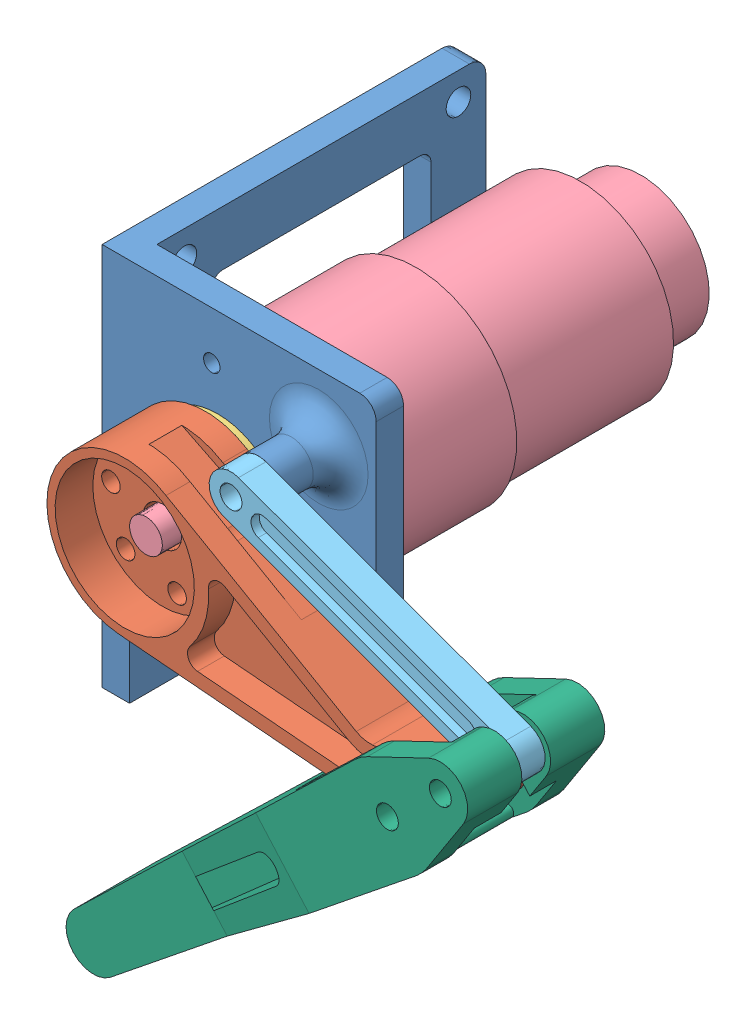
SolidWorks assembly Leg Assembly.SLDASM, configuration Default (file format 4700). Lengths in mm.
Overall size (97.2 105.25 94.13).
6 component instances, 6 part files, 13 mates.
Components (placement in the parent):
- Base-1: Base.SLDPRT [Default] at origin size (50 70 76)
- Thigh-1: Thigh.SLDPRT [Default] at (-1.709 -11.6035 11) x (0.999377 -0.035291 0) z (0 0 1) size (73.28 31.08 14.75)
- Hub-1: Hub.SLDPRT [Default] at (0 0 14) x (-0.929157 -0.369686 0) z (0 0 -1) size (25.4 25.4 9.14)
- Motor-1: Motor.SLDPRT [Default] at (5.2515 4.6283 -52) x (-0.750216 -0.661193 0) z (0 0 1) size (36.8 36.8 85)
- Link-1: Link.SLDPRT [Default] at (14.5161 12.8487 16) x (0.939509 -0.342524 0) z (0 0 1) size (59.42 8 5)
- Shin-1: Shin.SLDPRT [Default] at (53.1666 -13.2798 6.125) x (-0.750084 -0.661343 0) z (0 0 1) size (101.03 17 25)
Mates (geometry in assembly coordinates):
- Concentric1: concentric aligned: cylinder of Base-1 through (0 0 0) axis (0 0 -1) radius 6.5; cylinder of Motor-1 through (0 0 22) axis (0 0 -1) radius 3
- Concentric2: concentric anti-aligned: cylinder of Base-1 through (-4.997 16.2567 0) axis (0 0 -1) radius 1.5; cylinder of Motor-1 through (-4.997 16.2567 0) axis (0 0 1) radius 1.5
- Coincident1: coincident anti-aligned: plane of Base-1 through (-20 25 0) normal (0 0 -1); plane of Motor-1 through (-8.5525 -7.5376 0) normal (0 0 1)
- Concentric4: concentric anti-aligned: cylinder of Hub-1 through (0 0 5.106) axis (0 0 1) radius 2.9845; cylinder of Motor-1 through (0 0 22) axis (0 0 -1) radius 3
- Concentric6: concentric aligned: cylinder of Base-1 through (14.5161 12.8487 16) axis (0 0 -1) radius 1.6618; cylinder of Link-1 through (14.5161 12.8487 16) axis (0 0 -1) radius 2
- Coincident2: coincident anti-aligned: plane of Base-1 through (14.5161 12.8487 16) normal (0 0 1); plane of Link-1 through (14.5161 12.8487 16) normal (0 0 -1)
- Concentric7: concentric anti-aligned: cylinder of Thigh-1 through (0 0 11.25) axis (0 0 -1) radius 12.8; cylinder of Hub-1 through (0 0 9.17) axis (0 0 1) radius 12.7
- Coincident3: coincident anti-aligned: plane of Thigh-1 through (3.4978 -0.1235 14.25) normal (0 0 -1); plane of Hub-1 through (0 0 14.25) normal (0 0 1)
- Concentric8: concentric aligned: cylinder of Link-1 through (62.8253 -4.7638 16) axis (0 0 -1) radius 2; cylinder of Shin-1 through (62.8253 -4.7638 21.25) axis (0 0 -1) radius 2
- Coincident4: coincident anti-aligned: plane of Link-1 through (14.5161 12.8487 16) normal (0 0 -1); plane of Shin-1 through (62.8253 -4.7638 16) normal (0 0 1)
- Concentric9: concentric aligned: cylinder of Thigh-1 through (53.1666 -13.2798 11.25) axis (0 0 -1) radius 2; cylinder of Shin-1 through (53.1666 -13.2798 26.125) axis (0 0 -1) radius 2
- Coincident5: coincident anti-aligned: plane of Thigh-1 through (62.5477 -22.7763 11.125) normal (0 0 -1); plane of Shin-1 through (76.3586 -26.1612 11.125) normal (0 0 1)
- Tangent1: tangent anti-aligned: cylinder of Thigh-1 through (54.6008 -4.6681 26.25) axis (0 0 -1) radius 5.4803; plane of Link-1
